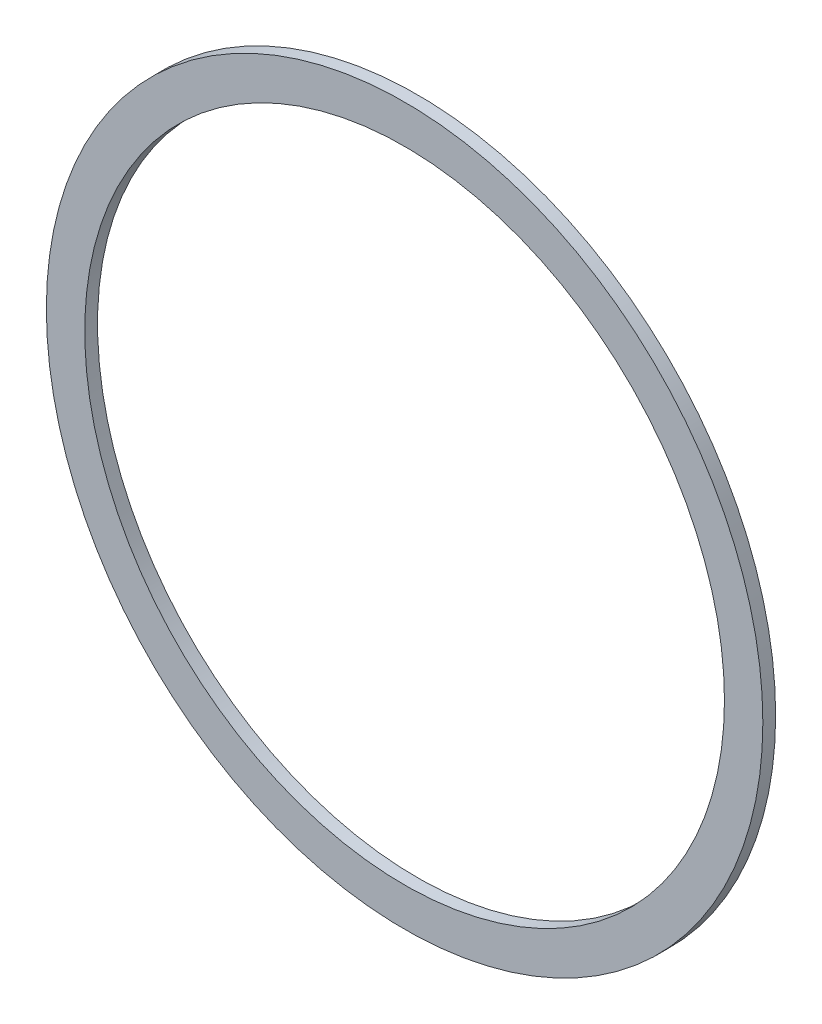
ISO-10303-21;
HEADER;
FILE_DESCRIPTION(('STEP AP214'),'2;1');
FILE_NAME('part.step','',(''),(''),'','','');
FILE_SCHEMA(('AUTOMOTIVE_DESIGN { 1 0 10303 214 1 1 1 1 }'));
ENDSEC;
DATA;
#1=APPLICATION_CONTEXT('core data for automotive mechanical design processes');
#2=APPLICATION_PROTOCOL_DEFINITION('international standard','automotive_design',2000,#1);
#3=PRODUCT_CONTEXT('',#1,'mechanical');
#4=PRODUCT('Part','Part','',(#3));
#5=PRODUCT_RELATED_PRODUCT_CATEGORY('part','',(#4));
#6=PRODUCT_DEFINITION_FORMATION('','',#4);
#7=PRODUCT_DEFINITION_CONTEXT('part definition',#1,'design');
#8=PRODUCT_DEFINITION('design','',#6,#7);
#9=PRODUCT_DEFINITION_SHAPE('','',#8);
#10=(LENGTH_UNIT() NAMED_UNIT(*) SI_UNIT(.MILLI.,.METRE.));
#11=(NAMED_UNIT(*) PLANE_ANGLE_UNIT() SI_UNIT($,.RADIAN.));
#12=(NAMED_UNIT(*) SI_UNIT($,.STERADIAN.) SOLID_ANGLE_UNIT());
#13=UNCERTAINTY_MEASURE_WITH_UNIT(LENGTH_MEASURE(1.E-05),#10,'distance_accuracy_value','');
#14=(GEOMETRIC_REPRESENTATION_CONTEXT(3) GLOBAL_UNCERTAINTY_ASSIGNED_CONTEXT((#13)) GLOBAL_UNIT_ASSIGNED_CONTEXT((#10,
#11,#12)) REPRESENTATION_CONTEXT('',''));
#15=CARTESIAN_POINT('',(0.,0.,0.));
#16=DIRECTION('',(0.,0.,1.));
#17=DIRECTION('',(1.,0.,0.));
#18=AXIS2_PLACEMENT_3D('',#15,#16,#17);
#19=CARTESIAN_POINT('',(0.,0.,1.));
#20=DIRECTION('',(0.,0.,1.));
#21=DIRECTION('',(1.,0.,0.));
#22=AXIS2_PLACEMENT_3D('',#19,#20,#21);
#23=PLANE('',#22);
#24=CARTESIAN_POINT('',(0.,0.,1.));
#25=DIRECTION('',(0.,0.,1.));
#26=DIRECTION('',(1.,0.,0.));
#27=AXIS2_PLACEMENT_3D('',#24,#25,#26);
#28=CIRCLE('',#27,28.);
#29=CARTESIAN_POINT('',(28.,0.,1.));
#30=VERTEX_POINT('',#29);
#31=EDGE_CURVE('E10',#30,#30,#28,.T.);
#32=ORIENTED_EDGE('',*,*,#31,.T.);
#33=EDGE_LOOP('',(#32));
#34=FACE_BOUND('',#33,.T.);
#35=CARTESIAN_POINT('',(0.,0.,1.));
#36=DIRECTION('',(0.,0.,1.));
#37=DIRECTION('',(1.,0.,0.));
#38=AXIS2_PLACEMENT_3D('',#35,#36,#37);
#39=CIRCLE('',#38,25.);
#40=CARTESIAN_POINT('',(25.,0.,1.));
#41=VERTEX_POINT('',#40);
#42=EDGE_CURVE('E43',#41,#41,#39,.T.);
#43=ORIENTED_EDGE('',*,*,#42,.F.);
#44=EDGE_LOOP('',(#43));
#45=FACE_BOUND('',#44,.T.);
#46=ADVANCED_FACE('F32',(#34,#45),#23,.T.);
#47=CARTESIAN_POINT('',(0.,0.,0.));
#48=DIRECTION('',(0.,0.,1.));
#49=DIRECTION('',(1.,0.,0.));
#50=AXIS2_PLACEMENT_3D('',#47,#48,#49);
#51=PLANE('',#50);
#52=CARTESIAN_POINT('',(0.,0.,0.));
#53=DIRECTION('',(0.,0.,1.));
#54=DIRECTION('',(1.,0.,0.));
#55=AXIS2_PLACEMENT_3D('',#52,#53,#54);
#56=CIRCLE('',#55,28.);
#57=CARTESIAN_POINT('',(28.,0.,0.));
#58=VERTEX_POINT('',#57);
#59=EDGE_CURVE('E36',#58,#58,#56,.T.);
#60=ORIENTED_EDGE('',*,*,#59,.F.);
#61=EDGE_LOOP('',(#60));
#62=FACE_BOUND('',#61,.T.);
#63=CARTESIAN_POINT('',(0.,0.,0.));
#64=DIRECTION('',(0.,0.,1.));
#65=DIRECTION('',(1.,0.,0.));
#66=AXIS2_PLACEMENT_3D('',#63,#64,#65);
#67=CIRCLE('',#66,25.);
#68=CARTESIAN_POINT('',(25.,0.,0.));
#69=VERTEX_POINT('',#68);
#70=EDGE_CURVE('E45',#69,#69,#67,.T.);
#71=ORIENTED_EDGE('',*,*,#70,.T.);
#72=EDGE_LOOP('',(#71));
#73=FACE_BOUND('',#72,.T.);
#74=ADVANCED_FACE('F55',(#62,#73),#51,.F.);
#75=CARTESIAN_POINT('',(0.,0.,1.));
#76=DIRECTION('',(0.,0.,-1.));
#77=DIRECTION('',(-1.,0.,0.));
#78=AXIS2_PLACEMENT_3D('',#75,#76,#77);
#79=CYLINDRICAL_SURFACE('',#78,28.);
#80=ORIENTED_EDGE('',*,*,#31,.F.);
#81=EDGE_LOOP('',(#80));
#82=FACE_BOUND('',#81,.T.);
#83=ORIENTED_EDGE('',*,*,#59,.T.);
#84=EDGE_LOOP('',(#83));
#85=FACE_BOUND('',#84,.T.);
#86=ADVANCED_FACE('F34',(#82,#85),#79,.T.);
#87=CARTESIAN_POINT('',(0.,0.,1.));
#88=DIRECTION('',(0.,0.,-1.));
#89=DIRECTION('',(-1.,0.,0.));
#90=AXIS2_PLACEMENT_3D('',#87,#88,#89);
#91=CYLINDRICAL_SURFACE('',#90,25.);
#92=ORIENTED_EDGE('',*,*,#42,.T.);
#93=EDGE_LOOP('',(#92));
#94=FACE_BOUND('',#93,.T.);
#95=ORIENTED_EDGE('',*,*,#70,.F.);
#96=EDGE_LOOP('',(#95));
#97=FACE_BOUND('',#96,.T.);
#98=ADVANCED_FACE('F51',(#94,#97),#91,.F.);
#99=CLOSED_SHELL('',(#46,#74,#86,#98));
#100=MANIFOLD_SOLID_BREP('B2',#99);
#101=ADVANCED_BREP_SHAPE_REPRESENTATION('',(#18,#100),#14);
#102=SHAPE_DEFINITION_REPRESENTATION(#9,#101);
ENDSEC;
END-ISO-10303-21;
